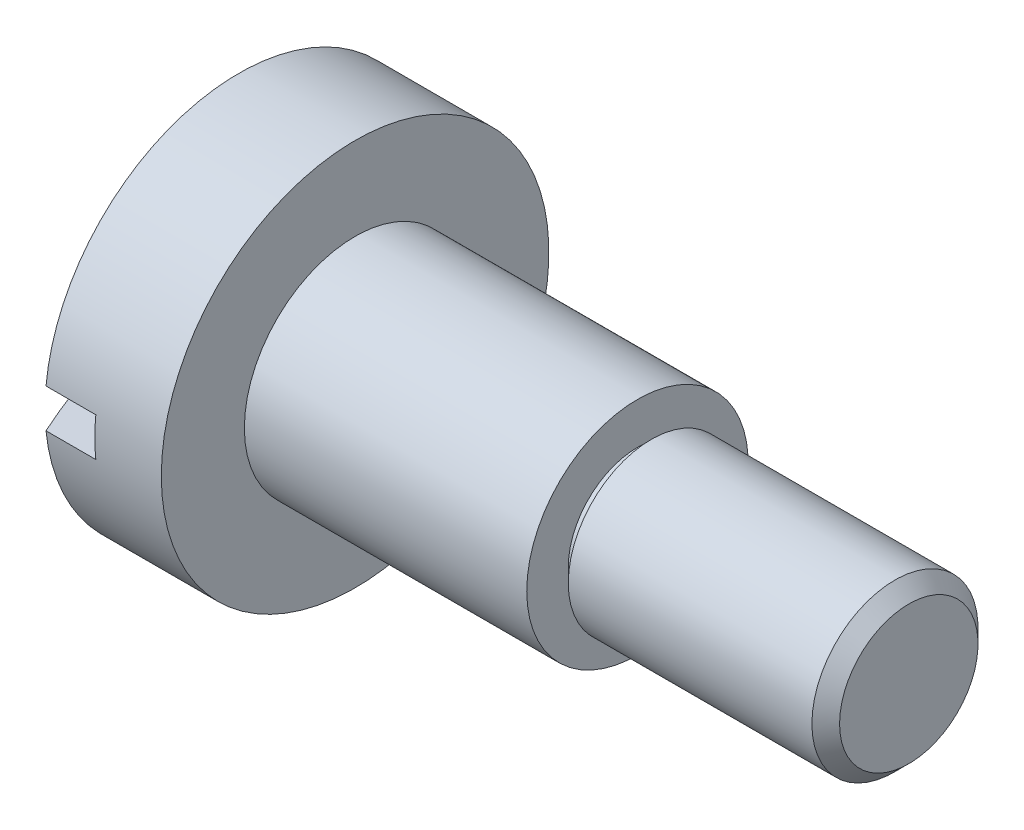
ISO-10303-21;
HEADER;
FILE_DESCRIPTION(('STEP AP214'),'2;1');
FILE_NAME('part.step','',(''),(''),'','','');
FILE_SCHEMA(('AUTOMOTIVE_DESIGN { 1 0 10303 214 1 1 1 1 }'));
ENDSEC;
DATA;
#1=APPLICATION_CONTEXT('core data for automotive mechanical design processes');
#2=APPLICATION_PROTOCOL_DEFINITION('international standard','automotive_design',2000,#1);
#3=PRODUCT_CONTEXT('',#1,'mechanical');
#4=PRODUCT('Part','Part','',(#3));
#5=PRODUCT_RELATED_PRODUCT_CATEGORY('part','',(#4));
#6=PRODUCT_DEFINITION_FORMATION('','',#4);
#7=PRODUCT_DEFINITION_CONTEXT('part definition',#1,'design');
#8=PRODUCT_DEFINITION('design','',#6,#7);
#9=PRODUCT_DEFINITION_SHAPE('','',#8);
#10=(LENGTH_UNIT() NAMED_UNIT(*) SI_UNIT(.MILLI.,.METRE.));
#11=(NAMED_UNIT(*) PLANE_ANGLE_UNIT() SI_UNIT($,.RADIAN.));
#12=(NAMED_UNIT(*) SI_UNIT($,.STERADIAN.) SOLID_ANGLE_UNIT());
#13=UNCERTAINTY_MEASURE_WITH_UNIT(LENGTH_MEASURE(1.E-05),#10,'distance_accuracy_value','');
#14=(GEOMETRIC_REPRESENTATION_CONTEXT(3) GLOBAL_UNCERTAINTY_ASSIGNED_CONTEXT((#13)) GLOBAL_UNIT_ASSIGNED_CONTEXT((#10,
#11,#12)) REPRESENTATION_CONTEXT('',''));
#15=CARTESIAN_POINT('',(0.,0.,0.));
#16=DIRECTION('',(0.,0.,1.));
#17=DIRECTION('',(1.,0.,0.));
#18=AXIS2_PLACEMENT_3D('',#15,#16,#17);
#19=CARTESIAN_POINT('',(4.64478581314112,0.,0.));
#20=DIRECTION('',(-1.,0.,0.));
#21=DIRECTION('',(0.,0.,1.));
#22=AXIS2_PLACEMENT_3D('',#19,#20,#21);
#23=DEGENERATE_TOROIDAL_SURFACE('',#22,1.84851023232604,21.,.F.);
#24=CARTESIAN_POINT('',(-16.2,-0.7,0.));
#25=CARTESIAN_POINT('',(-16.2000044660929,-0.7,-0.0586231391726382));
#26=CARTESIAN_POINT('',(-16.1990909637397,-0.7,-0.117245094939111));
#27=CARTESIAN_POINT('',(-16.1955679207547,-0.7,-0.234444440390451));
#28=CARTESIAN_POINT('',(-16.1929581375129,-0.7,-0.293021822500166));
#29=CARTESIAN_POINT('',(-16.1830089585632,-0.7,-0.468742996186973));
#30=CARTESIAN_POINT('',(-16.173550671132,-0.7,-0.585764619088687));
#31=CARTESIAN_POINT('',(-16.1509325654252,-0.7,-0.819587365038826));
#32=CARTESIAN_POINT('',(-16.1377677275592,-0.7,-0.936387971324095));
#33=CARTESIAN_POINT('',(-16.1086430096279,-0.7,-1.16964363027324));
#34=CARTESIAN_POINT('',(-16.0926829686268,-0.7,-1.28609866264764));
#35=CARTESIAN_POINT('',(-16.0412320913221,-0.7,-1.63500074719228));
#36=CARTESIAN_POINT('',(-16.0021767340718,-0.7,-1.86692597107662));
#37=CARTESIAN_POINT('',(-15.9156720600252,-0.7,-2.32955221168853));
#38=CARTESIAN_POINT('',(-15.8682102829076,-0.7,-2.56025088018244));
#39=CARTESIAN_POINT('',(-15.7652757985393,-0.7,-3.01982884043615));
#40=CARTESIAN_POINT('',(-15.7098034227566,-0.7,-3.24870820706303));
#41=CARTESIAN_POINT('',(-15.5025314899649,-0.7,-4.04410127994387));
#42=CARTESIAN_POINT('',(-15.3303773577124,-0.7,-4.60546168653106));
#43=CARTESIAN_POINT('',(-14.9393451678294,-0.7,-5.71190771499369));
#44=CARTESIAN_POINT('',(-14.7204406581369,-0.7,-6.25698392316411));
#45=CARTESIAN_POINT('',(-14.2375499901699,-0.7,-7.32696646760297));
#46=CARTESIAN_POINT('',(-13.9735534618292,-0.7,-7.85186813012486));
#47=CARTESIAN_POINT('',(-13.4024905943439,-0.7,-8.87757081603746));
#48=CARTESIAN_POINT('',(-13.095431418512,-0.7,-9.37837582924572));
#49=CARTESIAN_POINT('',(-12.4402708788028,-0.7,-10.3526533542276));
#50=CARTESIAN_POINT('',(-12.0921542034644,-0.7,-10.82611557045));
#51=CARTESIAN_POINT('',(-11.3574201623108,-0.7,-11.7421937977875));
#52=CARTESIAN_POINT('',(-10.970801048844,-0.7,-12.1848084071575));
#53=CARTESIAN_POINT('',(-10.1617215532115,-0.7,-13.036142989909));
#54=CARTESIAN_POINT('',(-9.73925378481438,-0.7,-13.4448559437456));
#55=CARTESIAN_POINT('',(-8.86153157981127,-0.7,-14.2254039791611));
#56=CARTESIAN_POINT('',(-8.40627744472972,-0.7,-14.5972393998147));
#57=CARTESIAN_POINT('',(-7.46415694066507,-0.7,-15.3029407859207));
#58=CARTESIAN_POINT('',(-6.97716258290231,-0.7,-15.6366359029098));
#59=CARTESIAN_POINT('',(-5.97679636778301,-0.7,-16.2618249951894));
#60=CARTESIAN_POINT('',(-5.4634243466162,-0.7,-16.5533187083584));
#61=CARTESIAN_POINT('',(-4.41402413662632,-0.7,-17.0919969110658));
#62=CARTESIAN_POINT('',(-3.87799898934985,-0.7,-17.3391873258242));
#63=CARTESIAN_POINT('',(-2.78703771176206,-0.7,-17.7875512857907));
#64=CARTESIAN_POINT('',(-2.23210160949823,-0.7,-17.9887248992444));
#65=CARTESIAN_POINT('',(-1.10707423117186,-0.7,-18.3436859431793));
#66=CARTESIAN_POINT('',(-0.536978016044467,-0.7,-18.4974577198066));
#67=CARTESIAN_POINT('',(0.614141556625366,-0.7,-18.7564326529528));
#68=CARTESIAN_POINT('',(1.19516492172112,-0.7,-18.8616357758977));
#69=CARTESIAN_POINT('',(2.36404217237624,-0.7,-19.0227304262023));
#70=CARTESIAN_POINT('',(2.95189645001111,-0.7,-19.0786191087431));
#71=CARTESIAN_POINT('',(4.13022346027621,-0.7,-19.140677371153));
#72=CARTESIAN_POINT('',(4.72069619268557,-0.7,-19.146846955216));
#73=CARTESIAN_POINT('',(5.90008815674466,-0.7,-19.1094223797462));
#74=CARTESIAN_POINT('',(6.4890073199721,-0.7,-19.0658260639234));
#75=CARTESIAN_POINT('',(7.66107952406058,-0.7,-18.9291760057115));
#76=CARTESIAN_POINT('',(8.24423256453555,-0.7,-18.8361222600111));
#77=CARTESIAN_POINT('',(9.40061099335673,-0.7,-18.601221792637));
#78=CARTESIAN_POINT('',(9.97383664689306,-0.7,-18.4593763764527));
#79=CARTESIAN_POINT('',(11.1063008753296,-0.7,-18.1279000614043));
#80=CARTESIAN_POINT('',(11.6655394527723,-0.7,-17.9382691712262));
#81=CARTESIAN_POINT('',(12.7660507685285,-0.7,-17.5125704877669));
#82=CARTESIAN_POINT('',(13.3073235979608,-0.7,-17.2765029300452));
#83=CARTESIAN_POINT('',(14.3680580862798,-0.7,-16.7596077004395));
#84=CARTESIAN_POINT('',(14.8875197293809,-0.7,-16.4787799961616));
#85=CARTESIAN_POINT('',(15.9009544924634,-0.7,-15.8743496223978));
#86=CARTESIAN_POINT('',(16.3949267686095,-0.7,-15.550745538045));
#87=CARTESIAN_POINT('',(17.3538481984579,-0.7,-14.8630716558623));
#88=CARTESIAN_POINT('',(17.8187974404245,-0.7,-14.4990019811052));
#89=CARTESIAN_POINT('',(18.7163449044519,-0.7,-13.7329983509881));
#90=CARTESIAN_POINT('',(19.1489449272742,-0.7,-13.3310665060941));
#91=CARTESIAN_POINT('',(19.9787342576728,-0.7,-12.49219313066));
#92=CARTESIAN_POINT('',(20.3759231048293,-0.7,-12.0552511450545));
#93=CARTESIAN_POINT('',(21.132089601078,-0.7,-11.1494024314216));
#94=CARTESIAN_POINT('',(21.4910688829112,-0.7,-10.6804970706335));
#95=CARTESIAN_POINT('',(21.9988296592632,-0.7,-9.95587085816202));
#96=CARTESIAN_POINT('',(22.1629680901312,-0.7,-9.71077917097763));
#97=CARTESIAN_POINT('',(22.480805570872,-0.7,-9.2138277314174));
#98=CARTESIAN_POINT('',(22.6345018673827,-0.7,-8.96196621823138));
#99=CARTESIAN_POINT('',(23.0793061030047,-0.7,-8.19719199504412));
#100=CARTESIAN_POINT('',(23.3543338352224,-0.7,-7.67479777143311));
#101=CARTESIAN_POINT('',(23.8592742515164,-0.7,-6.60876472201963));
#102=CARTESIAN_POINT('',(24.0891879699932,-0.7,-6.06512638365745));
#103=CARTESIAN_POINT('',(24.5023725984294,-0.7,-4.95991306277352));
#104=CARTESIAN_POINT('',(24.685615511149,-0.7,-4.39832754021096));
#105=CARTESIAN_POINT('',(24.923921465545,-0.7,-3.54611202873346));
#106=CARTESIAN_POINT('',(24.9972509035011,-0.7,-3.26046825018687));
#107=CARTESIAN_POINT('',(25.1314668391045,-0.7,-2.68626914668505));
#108=CARTESIAN_POINT('',(25.1923546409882,-0.7,-2.39771413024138));
#109=CARTESIAN_POINT('',(25.2795895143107,-0.7,-1.9323986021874));
#110=CARTESIAN_POINT('',(25.3100909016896,-0.7,-1.75640885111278));
#111=CARTESIAN_POINT('',(25.35190900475,-0.7,-1.49176272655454));
#112=CARTESIAN_POINT('',(25.3651953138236,-0.7,-1.40341669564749));
#113=CARTESIAN_POINT('',(25.3903381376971,-0.7,-1.2265196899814));
#114=CARTESIAN_POINT('',(25.4021946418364,-0.7,-1.1379687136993));
#115=CARTESIAN_POINT('',(25.4242323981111,-0.7,-0.961061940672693));
#116=CARTESIAN_POINT('',(25.4344209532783,-0.7,-0.872707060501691));
#117=CARTESIAN_POINT('',(25.4528253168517,-0.7,-0.695780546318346));
#118=CARTESIAN_POINT('',(25.4610409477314,-0.7,-0.607208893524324));
#119=CARTESIAN_POINT('',(25.4748204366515,-0.7,-0.429959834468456));
#120=CARTESIAN_POINT('',(25.4803875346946,-0.7,-0.341282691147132));
#121=CARTESIAN_POINT('',(25.4878623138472,-0.7,-0.163795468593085));
#122=CARTESIAN_POINT('',(25.4897714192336,-0.7,-0.0749854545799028));
#123=CARTESIAN_POINT('',(25.4893113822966,-0.7,0.113740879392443));
#124=CARTESIAN_POINT('',(25.4863767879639,-0.7,0.213655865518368));
#125=CARTESIAN_POINT('',(25.4761694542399,-0.7,0.413274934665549));
#126=CARTESIAN_POINT('',(25.4688952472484,-0.7,0.512978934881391));
#127=CARTESIAN_POINT('',(25.4513711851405,-0.7,0.712254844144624));
#128=CARTESIAN_POINT('',(25.4411171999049,-0.7,0.811826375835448));
#129=CARTESIAN_POINT('',(25.418367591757,-0.7,1.0106964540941));
#130=CARTESIAN_POINT('',(25.4058722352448,-0.7,1.10999503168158));
#131=CARTESIAN_POINT('',(25.3654831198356,-0.7,1.40840932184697));
#132=CARTESIAN_POINT('',(25.3347736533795,-0.7,1.60714657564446));
#133=CARTESIAN_POINT('',(25.2670614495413,-0.7,2.00337569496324));
#134=CARTESIAN_POINT('',(25.2300635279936,-0.7,2.200868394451));
#135=CARTESIAN_POINT('',(25.1495957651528,-0.7,2.59712744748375));
#136=CARTESIAN_POINT('',(25.1060501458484,-0.7,2.79587842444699));
#137=CARTESIAN_POINT('',(25.0130228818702,-0.7,3.19202667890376));
#138=CARTESIAN_POINT('',(24.9635400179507,-0.7,3.38942366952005));
#139=CARTESIAN_POINT('',(24.8588902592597,-0.7,3.78215362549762));
#140=CARTESIAN_POINT('',(24.8037386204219,-0.7,3.97749064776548));
#141=CARTESIAN_POINT('',(24.687735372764,-0.7,4.36644563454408));
#142=CARTESIAN_POINT('',(24.6268839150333,-0.7,4.56006364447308));
#143=CARTESIAN_POINT('',(24.3781017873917,-0.7,5.31296897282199));
#144=CARTESIAN_POINT('',(24.1691213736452,-0.7,5.86548495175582));
#145=CARTESIAN_POINT('',(23.704955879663,-0.7,6.95149611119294));
#146=CARTESIAN_POINT('',(23.4497101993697,-0.7,7.48496523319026));
#147=CARTESIAN_POINT('',(22.8972173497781,-0.7,8.5243745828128));
#148=CARTESIAN_POINT('',(22.600314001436,-0.7,9.0304973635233));
#149=CARTESIAN_POINT('',(21.9652910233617,-0.7,10.0158665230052));
#150=CARTESIAN_POINT('',(21.6271895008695,-0.7,10.4951245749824));
#151=CARTESIAN_POINT('',(20.9110182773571,-0.7,11.4249969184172));
#152=CARTESIAN_POINT('',(20.5328360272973,-0.7,11.8755245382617));
#153=CARTESIAN_POINT('',(19.7399342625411,-0.7,12.7433039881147));
#154=CARTESIAN_POINT('',(19.3252096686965,-0.7,13.1605511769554));
#155=CARTESIAN_POINT('',(18.4609328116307,-0.7,13.9599306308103));
#156=CARTESIAN_POINT('',(18.0112820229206,-0.7,14.3419563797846));
#157=CARTESIAN_POINT('',(17.0814345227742,-0.7,15.066784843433));
#158=CARTESIAN_POINT('',(16.6012389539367,-0.7,15.4095890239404));
#159=CARTESIAN_POINT('',(15.6131449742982,-0.7,16.0539193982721));
#160=CARTESIAN_POINT('',(15.1052162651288,-0.7,16.355399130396));
#161=CARTESIAN_POINT('',(14.0657550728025,-0.7,16.9144878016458));
#162=CARTESIAN_POINT('',(13.5342223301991,-0.7,17.1720962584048));
#163=CARTESIAN_POINT('',(12.4518712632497,-0.7,17.6413766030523));
#164=CARTESIAN_POINT('',(11.9010723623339,-0.7,17.8530932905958));
#165=CARTESIAN_POINT('',(10.7836089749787,-0.7,18.2294072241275));
#166=CARTESIAN_POINT('',(10.2169445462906,-0.7,18.3940046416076));
#167=CARTESIAN_POINT('',(9.07146247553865,-0.7,18.6749887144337));
#168=CARTESIAN_POINT('',(8.49263845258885,-0.7,18.7913493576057));
#169=CARTESIAN_POINT('',(7.32724576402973,-0.7,18.97490567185));
#170=CARTESIAN_POINT('',(6.74067708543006,-0.7,19.0421012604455));
#171=CARTESIAN_POINT('',(5.563776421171,-0.7,19.1268633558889));
#172=CARTESIAN_POINT('',(4.97344329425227,-0.7,19.1444140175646));
#173=CARTESIAN_POINT('',(3.79339743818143,-0.7,19.1297162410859));
#174=CARTESIAN_POINT('',(3.2036847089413,-0.7,19.0974678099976));
#175=CARTESIAN_POINT('',(2.02907325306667,-0.7,18.9834011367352));
#176=CARTESIAN_POINT('',(1.44417452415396,-0.7,18.9015829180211));
#177=CARTESIAN_POINT('',(0.283349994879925,-0.7,18.6889582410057));
#178=CARTESIAN_POINT('',(-0.292575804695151,-0.7,18.5581517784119));
#179=CARTESIAN_POINT('',(-1.43122631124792,-0.7,18.2485164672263));
#180=CARTESIAN_POINT('',(-1.99395405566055,-0.7,18.0696987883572));
#181=CARTESIAN_POINT('',(-3.10234639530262,-0.7,17.6652980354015));
#182=CARTESIAN_POINT('',(-3.6480110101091,-0.7,17.4397150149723));
#183=CARTESIAN_POINT('',(-4.71829772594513,-0.7,16.9434329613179));
#184=CARTESIAN_POINT('',(-5.24292377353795,-0.7,16.6727424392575));
#185=CARTESIAN_POINT('',(-6.26751546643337,-0.7,16.0881370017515));
#186=CARTESIAN_POINT('',(-6.7674810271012,-0.7,15.7742219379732));
#187=CARTESIAN_POINT('',(-7.73948229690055,-0.7,15.1052002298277));
#188=CARTESIAN_POINT('',(-8.21150138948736,-0.7,14.7500694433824));
#189=CARTESIAN_POINT('',(-9.12392442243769,-0.7,14.0012942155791));
#190=CARTESIAN_POINT('',(-9.56432874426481,-0.7,13.6076502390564));
#191=CARTESIAN_POINT('',(-10.4105910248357,-0.7,12.7844498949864));
#192=CARTESIAN_POINT('',(-10.8164326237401,-0.7,12.3548767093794));
#193=CARTESIAN_POINT('',(-11.5904623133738,-0.7,11.4630085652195));
#194=CARTESIAN_POINT('',(-11.9586484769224,-0.7,11.0007119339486));
#195=CARTESIAN_POINT('',(-12.6541271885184,-0.7,10.0475088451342));
#196=CARTESIAN_POINT('',(-12.9814867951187,-0.7,9.55665129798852));
#197=CARTESIAN_POINT('',(-13.593636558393,-0.7,8.54917298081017));
#198=CARTESIAN_POINT('',(-13.8784351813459,-0.7,8.03255736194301));
#199=CARTESIAN_POINT('',(-14.3540654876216,-0.7,7.07647934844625));
#200=CARTESIAN_POINT('',(-14.5524964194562,-0.7,6.64077688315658));
#201=CARTESIAN_POINT('',(-14.9190337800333,-0.7,5.75674683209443));
#202=CARTESIAN_POINT('',(-15.087137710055,-0.7,5.30841820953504));
#203=CARTESIAN_POINT('',(-15.3924520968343,-0.7,4.40020481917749));
#204=CARTESIAN_POINT('',(-15.5295931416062,-0.7,3.94029660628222));
#205=CARTESIAN_POINT('',(-15.7109459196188,-0.7,3.2443025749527));
#206=CARTESIAN_POINT('',(-15.7673290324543,-0.7,3.01132540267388));
#207=CARTESIAN_POINT('',(-15.8717996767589,-0.7,2.54352401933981));
#208=CARTESIAN_POINT('',(-15.9198880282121,-0.7,2.30869999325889));
#209=CARTESIAN_POINT('',(-15.9954447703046,-0.7,1.90152593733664));
#210=CARTESIAN_POINT('',(-16.0249642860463,-0.7,1.72955308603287));
#211=CARTESIAN_POINT('',(-16.0790198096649,-0.7,1.38472446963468));
#212=CARTESIAN_POINT('',(-16.1035533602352,-0.7,1.2118683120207));
#213=CARTESIAN_POINT('',(-16.1356640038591,-0.7,0.952415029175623));
#214=CARTESIAN_POINT('',(-16.1455682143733,-0.7,0.866104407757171));
#215=CARTESIAN_POINT('',(-16.1634801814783,-0.7,0.693276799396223));
#216=CARTESIAN_POINT('',(-16.1714878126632,-0.7,0.606759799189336));
#217=CARTESIAN_POINT('',(-16.184981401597,-0.7,0.433606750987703));
#218=CARTESIAN_POINT('',(-16.1904698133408,-0.7,0.34697090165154));
#219=CARTESIAN_POINT('',(-16.1979753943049,-0.7,0.173555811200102));
#220=CARTESIAN_POINT('',(-16.1999933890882,-0.7,0.0867766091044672));
#221=CARTESIAN_POINT('',(-16.2,-0.7,0.));
#222=B_SPLINE_CURVE_WITH_KNOTS('',3,(#24,#25,#26,#27,#28,#29,#30,#31,#32,#33,#34,#35,#36,#37,
#38,#39,#40,#41,#42,#43,#44,#45,#46,#47,#48,#49,#50,#51,#52,#53,#54,#55,#56,#57,#58,#59,#60,#61,
#62,#63,#64,#65,#66,#67,#68,#69,#70,#71,#72,#73,#74,#75,#76,#77,#78,#79,#80,#81,#82,#83,#84,#85,
#86,#87,#88,#89,#90,#91,#92,#93,#94,#95,#96,#97,#98,#99,#100,#101,#102,#103,#104,#105,#106,#107,
#108,#109,#110,#111,#112,#113,#114,#115,#116,#117,#118,#119,#120,#121,#122,#123,#124,#125,#126,
#127,#128,#129,#130,#131,#132,#133,#134,#135,#136,#137,#138,#139,#140,#141,#142,#143,#144,#145,
#146,#147,#148,#149,#150,#151,#152,#153,#154,#155,#156,#157,#158,#159,#160,#161,#162,#163,#164,
#165,#166,#167,#168,#169,#170,#171,#172,#173,#174,#175,#176,#177,#178,#179,#180,#181,#182,#183,
#184,#185,#186,#187,#188,#189,#190,#191,#192,#193,#194,#195,#196,#197,#198,#199,#200,#201,#202,
#203,#204,#205,#206,#207,#208,#209,#210,#211,#212,#213,#214,#215,#216,#217,#218,#219,#220,#221),
.UNSPECIFIED.,.T.,.F.,(4,2,2,2,2,2,2,2,2,2,2,2,2,2,2,2,2,2,2,2,2,2,2,2,2,2,2,2,2,2,2,2,2,2,2,2,
2,2,2,2,2,2,2,2,2,2,2,2,2,2,2,2,2,2,2,2,2,2,2,2,2,2,2,2,2,2,2,2,2,2,2,2,2,2,2,2,2,2,2,2,2,2,2,2,
2,2,2,2,2,2,2,2,2,2,2,2,2,2,4),(0.,0.175860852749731,0.351746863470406,0.70385207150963,
1.05643643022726,1.40904109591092,2.11442771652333,2.82086877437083,3.52728060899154,
5.28643757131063,7.04659254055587,8.80715284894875,10.5674206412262,12.3283469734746,
14.0893532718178,15.85072329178,17.612077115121,19.38103490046,21.150003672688,22.9187356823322,
24.6874650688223,26.4567779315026,28.2260920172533,29.995508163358,31.7649241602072,
33.5344168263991,35.3039096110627,37.0733550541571,38.8428001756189,40.6122363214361,
42.3816737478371,44.1511697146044,45.9206602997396,47.6900523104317,49.4594673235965,
51.228806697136,52.1135104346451,52.9984465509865,54.7672532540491,56.5360193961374,
58.3058441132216,59.1903450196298,60.0747531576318,60.6105234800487,60.8785320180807,
61.1465425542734,61.4133462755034,61.6801739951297,61.9466744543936,62.2130711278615,
62.5128145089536,62.8126593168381,63.1129217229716,63.4131484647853,64.0163038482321,
64.618999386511,65.2293003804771,65.839726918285,66.4485516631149,67.0573602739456,
68.8271374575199,70.5992497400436,72.3575133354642,74.1150069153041,75.8775734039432,
77.6403852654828,79.4083643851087,81.1762774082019,82.9461620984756,84.7160662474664,
86.4842347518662,88.2523968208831,90.0215111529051,91.7906284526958,93.5603103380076,
95.3299919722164,97.0996727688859,98.869353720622,100.638623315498,102.407890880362,
104.176824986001,105.945765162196,107.715746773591,109.48570702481,111.256500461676,
113.027384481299,114.795320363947,116.562904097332,117.998099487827,119.43341307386,
120.87191305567,121.590902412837,122.309820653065,122.833227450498,123.35689158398,
123.617507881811,123.878141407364,124.138520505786,124.398837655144),.UNSPECIFIED.);
#223=CARTESIAN_POINT('',(-14.4,-0.7,6.96491205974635));
#224=VERTEX_POINT('',#223);
#225=CARTESIAN_POINT('',(-14.4,-0.7,-6.96491205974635));
#226=VERTEX_POINT('',#225);
#227=EDGE_CURVE('E30',#224,#226,#222,.T.);
#228=ORIENTED_EDGE('',*,*,#227,.T.);
#229=CARTESIAN_POINT('',(-14.4,0.,0.));
#230=DIRECTION('',(-1.,0.,0.));
#231=DIRECTION('',(0.,0.,1.));
#232=AXIS2_PLACEMENT_3D('',#229,#230,#231);
#233=CIRCLE('',#232,7.);
#234=EDGE_CURVE('E125',#226,#224,#233,.T.);
#235=ORIENTED_EDGE('',*,*,#234,.T.);
#236=EDGE_LOOP('',(#228,#235));
#237=FACE_BOUND('',#236,.T.);
#238=ADVANCED_FACE('F15',(#237),#23,.F.);
#239=CARTESIAN_POINT('',(9.8,0.,0.));
#240=DIRECTION('',(-1.,0.,0.));
#241=DIRECTION('',(0.,0.,1.));
#242=AXIS2_PLACEMENT_3D('',#239,#240,#241);
#243=PLANE('',#242);
#244=CARTESIAN_POINT('',(9.8,0.,0.));
#245=DIRECTION('',(-1.,0.,0.));
#246=DIRECTION('',(0.,0.,1.));
#247=AXIS2_PLACEMENT_3D('',#244,#245,#246);
#248=CIRCLE('',#247,2.5);
#249=CARTESIAN_POINT('',(9.8,0.,2.5));
#250=VERTEX_POINT('',#249);
#251=EDGE_CURVE('E82',#250,#250,#248,.T.);
#252=ORIENTED_EDGE('',*,*,#251,.F.);
#253=EDGE_LOOP('',(#252));
#254=FACE_BOUND('',#253,.T.);
#255=ADVANCED_FACE('F17',(#254),#243,.F.);
#256=CARTESIAN_POINT('',(9.8,0.,0.));
#257=DIRECTION('',(-1.,0.,0.));
#258=DIRECTION('',(0.,0.,1.));
#259=AXIS2_PLACEMENT_3D('',#256,#257,#258);
#260=CONICAL_SURFACE('',#259,2.5,0.78539816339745);
#261=CARTESIAN_POINT('',(9.3,0.,0.));
#262=DIRECTION('',(-1.,0.,0.));
#263=DIRECTION('',(0.,0.,1.));
#264=AXIS2_PLACEMENT_3D('',#261,#262,#263);
#265=CIRCLE('',#264,3.);
#266=CARTESIAN_POINT('',(9.3,0.,3.));
#267=VERTEX_POINT('',#266);
#268=EDGE_CURVE('E88',#267,#267,#265,.T.);
#269=ORIENTED_EDGE('',*,*,#268,.F.);
#270=EDGE_LOOP('',(#269));
#271=FACE_BOUND('',#270,.T.);
#272=ORIENTED_EDGE('',*,*,#251,.T.);
#273=EDGE_LOOP('',(#272));
#274=FACE_BOUND('',#273,.T.);
#275=ADVANCED_FACE('F166',(#271,#274),#260,.T.);
#276=CARTESIAN_POINT('',(-16.2,0.,0.));
#277=DIRECTION('',(-1.,0.,0.));
#278=DIRECTION('',(0.,0.,1.));
#279=AXIS2_PLACEMENT_3D('',#276,#277,#278);
#280=CYLINDRICAL_SURFACE('',#279,3.);
#281=CARTESIAN_POINT('',(0.5,0.,0.));
#282=DIRECTION('',(-1.,0.,0.));
#283=DIRECTION('',(0.,0.,1.));
#284=AXIS2_PLACEMENT_3D('',#281,#282,#283);
#285=CIRCLE('',#284,3.);
#286=CARTESIAN_POINT('',(0.5,0.,3.));
#287=VERTEX_POINT('',#286);
#288=EDGE_CURVE('E96',#287,#287,#285,.T.);
#289=ORIENTED_EDGE('',*,*,#288,.F.);
#290=EDGE_LOOP('',(#289));
#291=FACE_BOUND('',#290,.T.);
#292=ORIENTED_EDGE('',*,*,#268,.T.);
#293=EDGE_LOOP('',(#292));
#294=FACE_BOUND('',#293,.T.);
#295=ADVANCED_FACE('F171',(#291,#294),#280,.T.);
#296=CARTESIAN_POINT('',(0.5,3.,0.));
#297=DIRECTION('',(1.,0.,0.));
#298=DIRECTION('',(0.,0.,-1.));
#299=AXIS2_PLACEMENT_3D('',#296,#297,#298);
#300=PLANE('',#299);
#301=CARTESIAN_POINT('',(0.5,0.,0.));
#302=DIRECTION('',(-1.,0.,0.));
#303=DIRECTION('',(0.,0.,1.));
#304=AXIS2_PLACEMENT_3D('',#301,#302,#303);
#305=CIRCLE('',#304,2.5);
#306=CARTESIAN_POINT('',(0.5,0.,2.5));
#307=VERTEX_POINT('',#306);
#308=EDGE_CURVE('E102',#307,#307,#305,.T.);
#309=ORIENTED_EDGE('',*,*,#308,.F.);
#310=EDGE_LOOP('',(#309));
#311=FACE_BOUND('',#310,.T.);
#312=ORIENTED_EDGE('',*,*,#288,.T.);
#313=EDGE_LOOP('',(#312));
#314=FACE_BOUND('',#313,.T.);
#315=ADVANCED_FACE('F176',(#311,#314),#300,.F.);
#316=CARTESIAN_POINT('',(-16.2,0.,0.));
#317=DIRECTION('',(-1.,0.,0.));
#318=DIRECTION('',(0.,0.,1.));
#319=AXIS2_PLACEMENT_3D('',#316,#317,#318);
#320=CYLINDRICAL_SURFACE('',#319,2.5);
#321=CARTESIAN_POINT('',(0.,0.,0.));
#322=DIRECTION('',(-1.,0.,0.));
#323=DIRECTION('',(0.,0.,1.));
#324=AXIS2_PLACEMENT_3D('',#321,#322,#323);
#325=CIRCLE('',#324,2.5);
#326=CARTESIAN_POINT('',(0.,0.,2.5));
#327=VERTEX_POINT('',#326);
#328=EDGE_CURVE('E106',#327,#327,#325,.T.);
#329=ORIENTED_EDGE('',*,*,#328,.F.);
#330=EDGE_LOOP('',(#329));
#331=FACE_BOUND('',#330,.T.);
#332=ORIENTED_EDGE('',*,*,#308,.T.);
#333=EDGE_LOOP('',(#332));
#334=FACE_BOUND('',#333,.T.);
#335=ADVANCED_FACE('F183',(#331,#334),#320,.T.);
#336=CARTESIAN_POINT('',(0.,2.5,0.));
#337=DIRECTION('',(-1.,0.,0.));
#338=DIRECTION('',(0.,0.,1.));
#339=AXIS2_PLACEMENT_3D('',#336,#337,#338);
#340=PLANE('',#339);
#341=CARTESIAN_POINT('',(0.,0.,0.));
#342=DIRECTION('',(-1.,0.,0.));
#343=DIRECTION('',(0.,0.,1.));
#344=AXIS2_PLACEMENT_3D('',#341,#342,#343);
#345=CIRCLE('',#344,4.);
#346=CARTESIAN_POINT('',(0.,0.,4.));
#347=VERTEX_POINT('',#346);
#348=EDGE_CURVE('E110',#347,#347,#345,.T.);
#349=ORIENTED_EDGE('',*,*,#348,.F.);
#350=EDGE_LOOP('',(#349));
#351=FACE_BOUND('',#350,.T.);
#352=ORIENTED_EDGE('',*,*,#328,.T.);
#353=EDGE_LOOP('',(#352));
#354=FACE_BOUND('',#353,.T.);
#355=ADVANCED_FACE('F187',(#351,#354),#340,.F.);
#356=CARTESIAN_POINT('',(-16.2,0.,0.));
#357=DIRECTION('',(-1.,0.,0.));
#358=DIRECTION('',(0.,0.,1.));
#359=AXIS2_PLACEMENT_3D('',#356,#357,#358);
#360=CYLINDRICAL_SURFACE('',#359,4.);
#361=CARTESIAN_POINT('',(-10.2,0.,0.));
#362=DIRECTION('',(-1.,0.,0.));
#363=DIRECTION('',(0.,0.,1.));
#364=AXIS2_PLACEMENT_3D('',#361,#362,#363);
#365=CIRCLE('',#364,4.);
#366=CARTESIAN_POINT('',(-10.2,0.,4.));
#367=VERTEX_POINT('',#366);
#368=EDGE_CURVE('E114',#367,#367,#365,.T.);
#369=ORIENTED_EDGE('',*,*,#368,.F.);
#370=EDGE_LOOP('',(#369));
#371=FACE_BOUND('',#370,.T.);
#372=ORIENTED_EDGE('',*,*,#348,.T.);
#373=EDGE_LOOP('',(#372));
#374=FACE_BOUND('',#373,.T.);
#375=ADVANCED_FACE('F191',(#371,#374),#360,.T.);
#376=CARTESIAN_POINT('',(-10.2,4.,0.));
#377=DIRECTION('',(-1.,0.,0.));
#378=DIRECTION('',(0.,0.,1.));
#379=AXIS2_PLACEMENT_3D('',#376,#377,#378);
#380=PLANE('',#379);
#381=CARTESIAN_POINT('',(-10.2,0.,0.));
#382=DIRECTION('',(-1.,0.,0.));
#383=DIRECTION('',(0.,0.,1.));
#384=AXIS2_PLACEMENT_3D('',#381,#382,#383);
#385=CIRCLE('',#384,7.);
#386=CARTESIAN_POINT('',(-10.2,0.,7.));
#387=VERTEX_POINT('',#386);
#388=EDGE_CURVE('E118',#387,#387,#385,.T.);
#389=ORIENTED_EDGE('',*,*,#388,.F.);
#390=EDGE_LOOP('',(#389));
#391=FACE_BOUND('',#390,.T.);
#392=ORIENTED_EDGE('',*,*,#368,.T.);
#393=EDGE_LOOP('',(#392));
#394=FACE_BOUND('',#393,.T.);
#395=ADVANCED_FACE('F161',(#391,#394),#380,.F.);
#396=CARTESIAN_POINT('',(-16.2,0.,0.));
#397=DIRECTION('',(-1.,0.,0.));
#398=DIRECTION('',(0.,0.,1.));
#399=AXIS2_PLACEMENT_3D('',#396,#397,#398);
#400=CYLINDRICAL_SURFACE('',#399,7.);
#401=CARTESIAN_POINT('',(-12.6,0.,0.));
#402=DIRECTION('',(1.,0.,0.));
#403=DIRECTION('',(0.,0.,-1.));
#404=AXIS2_PLACEMENT_3D('',#401,#402,#403);
#405=CIRCLE('',#404,7.);
#406=CARTESIAN_POINT('',(-12.6,0.7,6.96491205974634));
#407=VERTEX_POINT('',#406);
#408=CARTESIAN_POINT('',(-12.6,-0.7,6.96491205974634));
#409=VERTEX_POINT('',#408);
#410=EDGE_CURVE('E9',#407,#409,#405,.T.);
#411=ORIENTED_EDGE('',*,*,#410,.T.);
#412=DIRECTION('',(-1.,0.,0.));
#413=VECTOR('',#412,1.);
#414=CARTESIAN_POINT('',(-16.2,-0.7,6.96491205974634));
#415=LINE('',#414,#413);
#416=EDGE_CURVE('E126',#409,#224,#415,.T.);
#417=ORIENTED_EDGE('',*,*,#416,.T.);
#418=ORIENTED_EDGE('',*,*,#234,.F.);
#419=DIRECTION('',(-1.,0.,0.));
#420=VECTOR('',#419,1.);
#421=CARTESIAN_POINT('',(-16.2,-0.7,-6.96491205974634));
#422=LINE('',#421,#420);
#423=CARTESIAN_POINT('',(-12.6,-0.7,-6.96491205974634));
#424=VERTEX_POINT('',#423);
#425=EDGE_CURVE('E80',#226,#424,#422,.F.);
#426=ORIENTED_EDGE('',*,*,#425,.T.);
#427=CARTESIAN_POINT('',(-12.6,0.7,-6.96491205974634));
#428=VERTEX_POINT('',#427);
#429=EDGE_CURVE('E19',#424,#428,#405,.T.);
#430=ORIENTED_EDGE('',*,*,#429,.T.);
#431=DIRECTION('',(-1.,0.,0.));
#432=VECTOR('',#431,1.);
#433=CARTESIAN_POINT('',(-16.2,0.7,-6.96491205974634));
#434=LINE('',#433,#432);
#435=CARTESIAN_POINT('',(-14.4,0.7,-6.96491205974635));
#436=VERTEX_POINT('',#435);
#437=EDGE_CURVE('E55',#428,#436,#434,.T.);
#438=ORIENTED_EDGE('',*,*,#437,.T.);
#439=CARTESIAN_POINT('',(-14.4,0.7,6.96491205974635));
#440=VERTEX_POINT('',#439);
#441=EDGE_CURVE('E122',#440,#436,#233,.T.);
#442=ORIENTED_EDGE('',*,*,#441,.F.);
#443=DIRECTION('',(-1.,0.,0.));
#444=VECTOR('',#443,1.);
#445=CARTESIAN_POINT('',(-16.2,0.7,6.96491205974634));
#446=LINE('',#445,#444);
#447=EDGE_CURVE('E67',#440,#407,#446,.F.);
#448=ORIENTED_EDGE('',*,*,#447,.T.);
#449=EDGE_LOOP('',(#411,#417,#418,#426,#430,#438,#442,#448));
#450=FACE_BOUND('',#449,.T.);
#451=ORIENTED_EDGE('',*,*,#388,.T.);
#452=EDGE_LOOP('',(#451));
#453=FACE_BOUND('',#452,.T.);
#454=ADVANCED_FACE('F77',(#450,#453),#400,.T.);
#455=CARTESIAN_POINT('',(-16.2,0.7,0.));
#456=CARTESIAN_POINT('',(-16.2000044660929,0.7,0.0586231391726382));
#457=CARTESIAN_POINT('',(-16.1990909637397,0.7,0.117245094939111));
#458=CARTESIAN_POINT('',(-16.1955679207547,0.7,0.234444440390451));
#459=CARTESIAN_POINT('',(-16.1929581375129,0.7,0.293021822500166));
#460=CARTESIAN_POINT('',(-16.1830089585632,0.7,0.468742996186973));
#461=CARTESIAN_POINT('',(-16.173550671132,0.7,0.585764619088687));
#462=CARTESIAN_POINT('',(-16.1509325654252,0.7,0.819587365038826));
#463=CARTESIAN_POINT('',(-16.1377677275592,0.7,0.936387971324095));
#464=CARTESIAN_POINT('',(-16.1086430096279,0.7,1.16964363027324));
#465=CARTESIAN_POINT('',(-16.0926829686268,0.7,1.28609866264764));
#466=CARTESIAN_POINT('',(-16.0412320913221,0.7,1.63500074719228));
#467=CARTESIAN_POINT('',(-16.0021767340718,0.7,1.86692597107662));
#468=CARTESIAN_POINT('',(-15.9156720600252,0.7,2.32955221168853));
#469=CARTESIAN_POINT('',(-15.8682102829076,0.7,2.56025088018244));
#470=CARTESIAN_POINT('',(-15.7652757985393,0.7,3.01982884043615));
#471=CARTESIAN_POINT('',(-15.7098034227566,0.7,3.24870820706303));
#472=CARTESIAN_POINT('',(-15.5025314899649,0.7,4.04410127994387));
#473=CARTESIAN_POINT('',(-15.3303773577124,0.7,4.60546168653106));
#474=CARTESIAN_POINT('',(-14.9393451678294,0.7,5.71190771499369));
#475=CARTESIAN_POINT('',(-14.7204406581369,0.7,6.25698392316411));
#476=CARTESIAN_POINT('',(-14.2375499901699,0.7,7.32696646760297));
#477=CARTESIAN_POINT('',(-13.9735534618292,0.7,7.85186813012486));
#478=CARTESIAN_POINT('',(-13.4024905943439,0.7,8.87757081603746));
#479=CARTESIAN_POINT('',(-13.095431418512,0.7,9.37837582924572));
#480=CARTESIAN_POINT('',(-12.4402708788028,0.7,10.3526533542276));
#481=CARTESIAN_POINT('',(-12.0921542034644,0.7,10.82611557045));
#482=CARTESIAN_POINT('',(-11.3574201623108,0.7,11.7421937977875));
#483=CARTESIAN_POINT('',(-10.970801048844,0.7,12.1848084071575));
#484=CARTESIAN_POINT('',(-10.1617215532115,0.7,13.036142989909));
#485=CARTESIAN_POINT('',(-9.73925378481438,0.7,13.4448559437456));
#486=CARTESIAN_POINT('',(-8.86153157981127,0.7,14.2254039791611));
#487=CARTESIAN_POINT('',(-8.40627744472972,0.7,14.5972393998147));
#488=CARTESIAN_POINT('',(-7.46415694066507,0.7,15.3029407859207));
#489=CARTESIAN_POINT('',(-6.97716258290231,0.7,15.6366359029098));
#490=CARTESIAN_POINT('',(-5.97679636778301,0.7,16.2618249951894));
#491=CARTESIAN_POINT('',(-5.4634243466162,0.7,16.5533187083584));
#492=CARTESIAN_POINT('',(-4.41402413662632,0.7,17.0919969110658));
#493=CARTESIAN_POINT('',(-3.87799898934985,0.7,17.3391873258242));
#494=CARTESIAN_POINT('',(-2.78703771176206,0.7,17.7875512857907));
#495=CARTESIAN_POINT('',(-2.23210160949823,0.7,17.9887248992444));
#496=CARTESIAN_POINT('',(-1.10707423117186,0.7,18.3436859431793));
#497=CARTESIAN_POINT('',(-0.536978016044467,0.7,18.4974577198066));
#498=CARTESIAN_POINT('',(0.614141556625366,0.7,18.7564326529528));
#499=CARTESIAN_POINT('',(1.19516492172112,0.7,18.8616357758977));
#500=CARTESIAN_POINT('',(2.36404217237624,0.7,19.0227304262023));
#501=CARTESIAN_POINT('',(2.95189645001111,0.7,19.0786191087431));
#502=CARTESIAN_POINT('',(4.13022346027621,0.7,19.140677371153));
#503=CARTESIAN_POINT('',(4.72069619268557,0.7,19.146846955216));
#504=CARTESIAN_POINT('',(5.90008815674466,0.7,19.1094223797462));
#505=CARTESIAN_POINT('',(6.4890073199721,0.7,19.0658260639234));
#506=CARTESIAN_POINT('',(7.66107952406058,0.7,18.9291760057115));
#507=CARTESIAN_POINT('',(8.24423256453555,0.7,18.8361222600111));
#508=CARTESIAN_POINT('',(9.40061099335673,0.7,18.601221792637));
#509=CARTESIAN_POINT('',(9.97383664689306,0.7,18.4593763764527));
#510=CARTESIAN_POINT('',(11.1063008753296,0.7,18.1279000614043));
#511=CARTESIAN_POINT('',(11.6655394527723,0.7,17.9382691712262));
#512=CARTESIAN_POINT('',(12.7660507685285,0.7,17.5125704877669));
#513=CARTESIAN_POINT('',(13.3073235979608,0.7,17.2765029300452));
#514=CARTESIAN_POINT('',(14.3680580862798,0.7,16.7596077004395));
#515=CARTESIAN_POINT('',(14.8875197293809,0.7,16.4787799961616));
#516=CARTESIAN_POINT('',(15.9009544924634,0.7,15.8743496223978));
#517=CARTESIAN_POINT('',(16.3949267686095,0.7,15.550745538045));
#518=CARTESIAN_POINT('',(17.3538481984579,0.7,14.8630716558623));
#519=CARTESIAN_POINT('',(17.8187974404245,0.7,14.4990019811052));
#520=CARTESIAN_POINT('',(18.7163449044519,0.7,13.7329983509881));
#521=CARTESIAN_POINT('',(19.1489449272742,0.7,13.3310665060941));
#522=CARTESIAN_POINT('',(19.9787342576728,0.7,12.49219313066));
#523=CARTESIAN_POINT('',(20.3759231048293,0.7,12.0552511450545));
#524=CARTESIAN_POINT('',(21.132089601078,0.7,11.1494024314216));
#525=CARTESIAN_POINT('',(21.4910688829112,0.7,10.6804970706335));
#526=CARTESIAN_POINT('',(21.9988296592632,0.7,9.95587085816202));
#527=CARTESIAN_POINT('',(22.1629680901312,0.7,9.71077917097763));
#528=CARTESIAN_POINT('',(22.480805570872,0.7,9.2138277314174));
#529=CARTESIAN_POINT('',(22.6345018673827,0.7,8.96196621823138));
#530=CARTESIAN_POINT('',(23.0793061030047,0.7,8.19719199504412));
#531=CARTESIAN_POINT('',(23.3543338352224,0.7,7.67479777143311));
#532=CARTESIAN_POINT('',(23.8592742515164,0.7,6.60876472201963));
#533=CARTESIAN_POINT('',(24.0891879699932,0.7,6.06512638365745));
#534=CARTESIAN_POINT('',(24.5023725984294,0.7,4.95991306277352));
#535=CARTESIAN_POINT('',(24.685615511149,0.7,4.39832754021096));
#536=CARTESIAN_POINT('',(24.923921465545,0.7,3.54611202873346));
#537=CARTESIAN_POINT('',(24.9972509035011,0.7,3.26046825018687));
#538=CARTESIAN_POINT('',(25.1314668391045,0.7,2.68626914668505));
#539=CARTESIAN_POINT('',(25.1923546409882,0.7,2.39771413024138));
#540=CARTESIAN_POINT('',(25.2795895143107,0.7,1.9323986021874));
#541=CARTESIAN_POINT('',(25.3100909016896,0.7,1.75640885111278));
#542=CARTESIAN_POINT('',(25.35190900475,0.7,1.49176272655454));
#543=CARTESIAN_POINT('',(25.3651953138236,0.7,1.40341669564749));
#544=CARTESIAN_POINT('',(25.3903381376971,0.7,1.2265196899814));
#545=CARTESIAN_POINT('',(25.4021946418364,0.7,1.1379687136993));
#546=CARTESIAN_POINT('',(25.4242323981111,0.7,0.961061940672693));
#547=CARTESIAN_POINT('',(25.4344209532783,0.7,0.872707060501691));
#548=CARTESIAN_POINT('',(25.4528253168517,0.7,0.695780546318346));
#549=CARTESIAN_POINT('',(25.4610409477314,0.7,0.607208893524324));
#550=CARTESIAN_POINT('',(25.4748204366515,0.7,0.429959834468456));
#551=CARTESIAN_POINT('',(25.4803875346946,0.7,0.341282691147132));
#552=CARTESIAN_POINT('',(25.4878623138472,0.7,0.163795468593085));
#553=CARTESIAN_POINT('',(25.4897714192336,0.7,0.0749854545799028));
#554=CARTESIAN_POINT('',(25.4893113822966,0.7,-0.113740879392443));
#555=CARTESIAN_POINT('',(25.4863767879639,0.7,-0.213655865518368));
#556=CARTESIAN_POINT('',(25.4761694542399,0.7,-0.413274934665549));
#557=CARTESIAN_POINT('',(25.4688952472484,0.7,-0.512978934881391));
#558=CARTESIAN_POINT('',(25.4513711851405,0.7,-0.712254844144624));
#559=CARTESIAN_POINT('',(25.4411171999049,0.7,-0.811826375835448));
#560=CARTESIAN_POINT('',(25.418367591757,0.7,-1.0106964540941));
#561=CARTESIAN_POINT('',(25.4058722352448,0.7,-1.10999503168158));
#562=CARTESIAN_POINT('',(25.3654831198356,0.7,-1.40840932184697));
#563=CARTESIAN_POINT('',(25.3347736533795,0.7,-1.60714657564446));
#564=CARTESIAN_POINT('',(25.2670614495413,0.7,-2.00337569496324));
#565=CARTESIAN_POINT('',(25.2300635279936,0.7,-2.200868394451));
#566=CARTESIAN_POINT('',(25.1495957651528,0.7,-2.59712744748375));
#567=CARTESIAN_POINT('',(25.1060501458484,0.7,-2.79587842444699));
#568=CARTESIAN_POINT('',(25.0130228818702,0.7,-3.19202667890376));
#569=CARTESIAN_POINT('',(24.9635400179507,0.7,-3.38942366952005));
#570=CARTESIAN_POINT('',(24.8588902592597,0.7,-3.78215362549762));
#571=CARTESIAN_POINT('',(24.8037386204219,0.7,-3.97749064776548));
#572=CARTESIAN_POINT('',(24.687735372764,0.7,-4.36644563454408));
#573=CARTESIAN_POINT('',(24.6268839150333,0.7,-4.56006364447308));
#574=CARTESIAN_POINT('',(24.3781017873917,0.7,-5.31296897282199));
#575=CARTESIAN_POINT('',(24.1691213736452,0.7,-5.86548495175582));
#576=CARTESIAN_POINT('',(23.704955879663,0.7,-6.95149611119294));
#577=CARTESIAN_POINT('',(23.4497101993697,0.7,-7.48496523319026));
#578=CARTESIAN_POINT('',(22.8972173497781,0.7,-8.5243745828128));
#579=CARTESIAN_POINT('',(22.600314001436,0.7,-9.0304973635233));
#580=CARTESIAN_POINT('',(21.9652910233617,0.7,-10.0158665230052));
#581=CARTESIAN_POINT('',(21.6271895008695,0.7,-10.4951245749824));
#582=CARTESIAN_POINT('',(20.9110182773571,0.7,-11.4249969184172));
#583=CARTESIAN_POINT('',(20.5328360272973,0.7,-11.8755245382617));
#584=CARTESIAN_POINT('',(19.7399342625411,0.7,-12.7433039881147));
#585=CARTESIAN_POINT('',(19.3252096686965,0.7,-13.1605511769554));
#586=CARTESIAN_POINT('',(18.4609328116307,0.7,-13.9599306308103));
#587=CARTESIAN_POINT('',(18.0112820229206,0.7,-14.3419563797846));
#588=CARTESIAN_POINT('',(17.0814345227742,0.7,-15.066784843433));
#589=CARTESIAN_POINT('',(16.6012389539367,0.7,-15.4095890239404));
#590=CARTESIAN_POINT('',(15.6131449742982,0.7,-16.0539193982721));
#591=CARTESIAN_POINT('',(15.1052162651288,0.7,-16.355399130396));
#592=CARTESIAN_POINT('',(14.0657550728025,0.7,-16.9144878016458));
#593=CARTESIAN_POINT('',(13.5342223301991,0.7,-17.1720962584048));
#594=CARTESIAN_POINT('',(12.4518712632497,0.7,-17.6413766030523));
#595=CARTESIAN_POINT('',(11.9010723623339,0.7,-17.8530932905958));
#596=CARTESIAN_POINT('',(10.7836089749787,0.7,-18.2294072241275));
#597=CARTESIAN_POINT('',(10.2169445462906,0.7,-18.3940046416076));
#598=CARTESIAN_POINT('',(9.07146247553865,0.7,-18.6749887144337));
#599=CARTESIAN_POINT('',(8.49263845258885,0.7,-18.7913493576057));
#600=CARTESIAN_POINT('',(7.32724576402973,0.7,-18.97490567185));
#601=CARTESIAN_POINT('',(6.74067708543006,0.7,-19.0421012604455));
#602=CARTESIAN_POINT('',(5.563776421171,0.7,-19.1268633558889));
#603=CARTESIAN_POINT('',(4.97344329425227,0.7,-19.1444140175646));
#604=CARTESIAN_POINT('',(3.79339743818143,0.7,-19.1297162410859));
#605=CARTESIAN_POINT('',(3.2036847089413,0.7,-19.0974678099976));
#606=CARTESIAN_POINT('',(2.02907325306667,0.7,-18.9834011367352));
#607=CARTESIAN_POINT('',(1.44417452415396,0.7,-18.9015829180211));
#608=CARTESIAN_POINT('',(0.283349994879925,0.7,-18.6889582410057));
#609=CARTESIAN_POINT('',(-0.292575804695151,0.7,-18.5581517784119));
#610=CARTESIAN_POINT('',(-1.43122631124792,0.7,-18.2485164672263));
#611=CARTESIAN_POINT('',(-1.99395405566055,0.7,-18.0696987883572));
#612=CARTESIAN_POINT('',(-3.10234639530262,0.7,-17.6652980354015));
#613=CARTESIAN_POINT('',(-3.6480110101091,0.7,-17.4397150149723));
#614=CARTESIAN_POINT('',(-4.71829772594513,0.7,-16.9434329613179));
#615=CARTESIAN_POINT('',(-5.24292377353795,0.7,-16.6727424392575));
#616=CARTESIAN_POINT('',(-6.26751546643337,0.7,-16.0881370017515));
#617=CARTESIAN_POINT('',(-6.7674810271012,0.7,-15.7742219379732));
#618=CARTESIAN_POINT('',(-7.73948229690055,0.7,-15.1052002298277));
#619=CARTESIAN_POINT('',(-8.21150138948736,0.7,-14.7500694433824));
#620=CARTESIAN_POINT('',(-9.12392442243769,0.7,-14.0012942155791));
#621=CARTESIAN_POINT('',(-9.56432874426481,0.7,-13.6076502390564));
#622=CARTESIAN_POINT('',(-10.4105910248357,0.7,-12.7844498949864));
#623=CARTESIAN_POINT('',(-10.8164326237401,0.7,-12.3548767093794));
#624=CARTESIAN_POINT('',(-11.5904623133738,0.7,-11.4630085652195));
#625=CARTESIAN_POINT('',(-11.9586484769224,0.7,-11.0007119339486));
#626=CARTESIAN_POINT('',(-12.6541271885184,0.7,-10.0475088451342));
#627=CARTESIAN_POINT('',(-12.9814867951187,0.7,-9.55665129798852));
#628=CARTESIAN_POINT('',(-13.593636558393,0.7,-8.54917298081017));
#629=CARTESIAN_POINT('',(-13.8784351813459,0.7,-8.03255736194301));
#630=CARTESIAN_POINT('',(-14.3540654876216,0.7,-7.07647934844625));
#631=CARTESIAN_POINT('',(-14.5524964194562,0.7,-6.64077688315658));
#632=CARTESIAN_POINT('',(-14.9190337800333,0.7,-5.75674683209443));
#633=CARTESIAN_POINT('',(-15.087137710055,0.7,-5.30841820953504));
#634=CARTESIAN_POINT('',(-15.3924520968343,0.7,-4.40020481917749));
#635=CARTESIAN_POINT('',(-15.5295931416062,0.7,-3.94029660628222));
#636=CARTESIAN_POINT('',(-15.7109459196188,0.7,-3.2443025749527));
#637=CARTESIAN_POINT('',(-15.7673290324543,0.7,-3.01132540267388));
#638=CARTESIAN_POINT('',(-15.8717996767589,0.7,-2.54352401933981));
#639=CARTESIAN_POINT('',(-15.9198880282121,0.7,-2.30869999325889));
#640=CARTESIAN_POINT('',(-15.9954447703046,0.7,-1.90152593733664));
#641=CARTESIAN_POINT('',(-16.0249642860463,0.7,-1.72955308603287));
#642=CARTESIAN_POINT('',(-16.0790198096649,0.7,-1.38472446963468));
#643=CARTESIAN_POINT('',(-16.1035533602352,0.7,-1.2118683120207));
#644=CARTESIAN_POINT('',(-16.1356640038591,0.7,-0.952415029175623));
#645=CARTESIAN_POINT('',(-16.1455682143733,0.7,-0.866104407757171));
#646=CARTESIAN_POINT('',(-16.1634801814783,0.7,-0.693276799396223));
#647=CARTESIAN_POINT('',(-16.1714878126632,0.7,-0.606759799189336));
#648=CARTESIAN_POINT('',(-16.184981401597,0.7,-0.433606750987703));
#649=CARTESIAN_POINT('',(-16.1904698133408,0.7,-0.34697090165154));
#650=CARTESIAN_POINT('',(-16.1979753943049,0.7,-0.173555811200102));
#651=CARTESIAN_POINT('',(-16.1999933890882,0.7,-0.0867766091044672));
#652=CARTESIAN_POINT('',(-16.2,0.7,0.));
#653=B_SPLINE_CURVE_WITH_KNOTS('',3,(#455,#456,#457,#458,#459,#460,#461,#462,#463,#464,#465,
#466,#467,#468,#469,#470,#471,#472,#473,#474,#475,#476,#477,#478,#479,#480,#481,#482,#483,#484,
#485,#486,#487,#488,#489,#490,#491,#492,#493,#494,#495,#496,#497,#498,#499,#500,#501,#502,#503,
#504,#505,#506,#507,#508,#509,#510,#511,#512,#513,#514,#515,#516,#517,#518,#519,#520,#521,#522,
#523,#524,#525,#526,#527,#528,#529,#530,#531,#532,#533,#534,#535,#536,#537,#538,#539,#540,#541,
#542,#543,#544,#545,#546,#547,#548,#549,#550,#551,#552,#553,#554,#555,#556,#557,#558,#559,#560,
#561,#562,#563,#564,#565,#566,#567,#568,#569,#570,#571,#572,#573,#574,#575,#576,#577,#578,#579,
#580,#581,#582,#583,#584,#585,#586,#587,#588,#589,#590,#591,#592,#593,#594,#595,#596,#597,#598,
#599,#600,#601,#602,#603,#604,#605,#606,#607,#608,#609,#610,#611,#612,#613,#614,#615,#616,#617,
#618,#619,#620,#621,#622,#623,#624,#625,#626,#627,#628,#629,#630,#631,#632,#633,#634,#635,#636,
#637,#638,#639,#640,#641,#642,#643,#644,#645,#646,#647,#648,#649,#650,#651,#652),.UNSPECIFIED.,
.T.,.F.,(4,2,2,2,2,2,2,2,2,2,2,2,2,2,2,2,2,2,2,2,2,2,2,2,2,2,2,2,2,2,2,2,2,2,2,2,2,2,2,2,2,2,2,
2,2,2,2,2,2,2,2,2,2,2,2,2,2,2,2,2,2,2,2,2,2,2,2,2,2,2,2,2,2,2,2,2,2,2,2,2,2,2,2,2,2,2,2,2,2,2,2,
2,2,2,2,2,2,2,4),(0.,0.175860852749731,0.351746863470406,0.70385207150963,1.05643643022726,
1.40904109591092,2.11442771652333,2.82086877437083,3.52728060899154,5.28643757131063,
7.04659254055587,8.80715284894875,10.5674206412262,12.3283469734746,14.0893532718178,
15.85072329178,17.612077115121,19.38103490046,21.150003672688,22.9187356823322,24.6874650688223,
26.4567779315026,28.2260920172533,29.995508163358,31.7649241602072,33.5344168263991,
35.3039096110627,37.0733550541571,38.8428001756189,40.6122363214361,42.3816737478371,
44.1511697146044,45.9206602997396,47.6900523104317,49.4594673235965,51.228806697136,
52.1135104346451,52.9984465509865,54.7672532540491,56.5360193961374,58.3058441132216,
59.1903450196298,60.0747531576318,60.6105234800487,60.8785320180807,61.1465425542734,
61.4133462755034,61.6801739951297,61.9466744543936,62.2130711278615,62.5128145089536,
62.8126593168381,63.1129217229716,63.4131484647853,64.0163038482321,64.618999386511,
65.2293003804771,65.839726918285,66.4485516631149,67.0573602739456,68.8271374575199,
70.5992497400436,72.3575133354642,74.1150069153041,75.8775734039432,77.6403852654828,
79.4083643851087,81.1762774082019,82.9461620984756,84.7160662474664,86.4842347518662,
88.2523968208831,90.0215111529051,91.7906284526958,93.5603103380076,95.3299919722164,
97.0996727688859,98.869353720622,100.638623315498,102.407890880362,104.176824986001,
105.945765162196,107.715746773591,109.48570702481,111.256500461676,113.027384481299,
114.795320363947,116.562904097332,117.998099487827,119.43341307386,120.87191305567,
121.590902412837,122.309820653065,122.833227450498,123.35689158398,123.617507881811,
123.878141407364,124.138520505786,124.398837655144),.UNSPECIFIED.);
#654=EDGE_CURVE('E61',#436,#440,#653,.T.);
#655=ORIENTED_EDGE('',*,*,#654,.T.);
#656=ORIENTED_EDGE('',*,*,#441,.T.);
#657=EDGE_LOOP('',(#655,#656));
#658=FACE_BOUND('',#657,.T.);
#659=ADVANCED_FACE('F136',(#658),#23,.F.);
#660=CARTESIAN_POINT('',(-12.6,0.,-14.));
#661=DIRECTION('',(1.,0.,0.));
#662=DIRECTION('',(0.,0.,-1.));
#663=AXIS2_PLACEMENT_3D('',#660,#661,#662);
#664=PLANE('',#663);
#665=DIRECTION('',(0.,0.,1.));
#666=VECTOR('',#665,1.);
#667=CARTESIAN_POINT('',(-12.6,0.7,-14.));
#668=LINE('',#667,#666);
#669=EDGE_CURVE('E59',#428,#407,#668,.T.);
#670=ORIENTED_EDGE('',*,*,#669,.F.);
#671=ORIENTED_EDGE('',*,*,#429,.F.);
#672=DIRECTION('',(0.,0.,1.));
#673=VECTOR('',#672,1.);
#674=CARTESIAN_POINT('',(-12.6,-0.7,-14.));
#675=LINE('',#674,#673);
#676=EDGE_CURVE('E74',#424,#409,#675,.T.);
#677=ORIENTED_EDGE('',*,*,#676,.T.);
#678=ORIENTED_EDGE('',*,*,#410,.F.);
#679=EDGE_LOOP('',(#670,#671,#677,#678));
#680=FACE_BOUND('',#679,.T.);
#681=ADVANCED_FACE('F70',(#680),#664,.F.);
#682=CARTESIAN_POINT('',(-15.6,-0.7,-14.));
#683=DIRECTION('',(0.,-1.,0.));
#684=DIRECTION('',(0.,0.,-1.));
#685=AXIS2_PLACEMENT_3D('',#682,#683,#684);
#686=PLANE('',#685);
#687=ORIENTED_EDGE('',*,*,#676,.F.);
#688=ORIENTED_EDGE('',*,*,#425,.F.);
#689=ORIENTED_EDGE('',*,*,#227,.F.);
#690=ORIENTED_EDGE('',*,*,#416,.F.);
#691=EDGE_LOOP('',(#687,#688,#689,#690));
#692=FACE_BOUND('',#691,.T.);
#693=ADVANCED_FACE('F139',(#692),#686,.F.);
#694=CARTESIAN_POINT('',(-15.6,0.7,-14.));
#695=DIRECTION('',(0.,1.,0.));
#696=DIRECTION('',(0.,0.,1.));
#697=AXIS2_PLACEMENT_3D('',#694,#695,#696);
#698=PLANE('',#697);
#699=ORIENTED_EDGE('',*,*,#669,.T.);
#700=ORIENTED_EDGE('',*,*,#447,.F.);
#701=ORIENTED_EDGE('',*,*,#654,.F.);
#702=ORIENTED_EDGE('',*,*,#437,.F.);
#703=EDGE_LOOP('',(#699,#700,#701,#702));
#704=FACE_BOUND('',#703,.T.);
#705=ADVANCED_FACE('F57',(#704),#698,.F.);
#706=CLOSED_SHELL('',(#238,#255,#275,#295,#315,#335,#355,#375,#395,#454,#659,#681,#693,#705));
#707=MANIFOLD_SOLID_BREP('B1',#706);
#708=ADVANCED_BREP_SHAPE_REPRESENTATION('',(#18,#707),#14);
#709=SHAPE_DEFINITION_REPRESENTATION(#9,#708);
ENDSEC;
END-ISO-10303-21;
